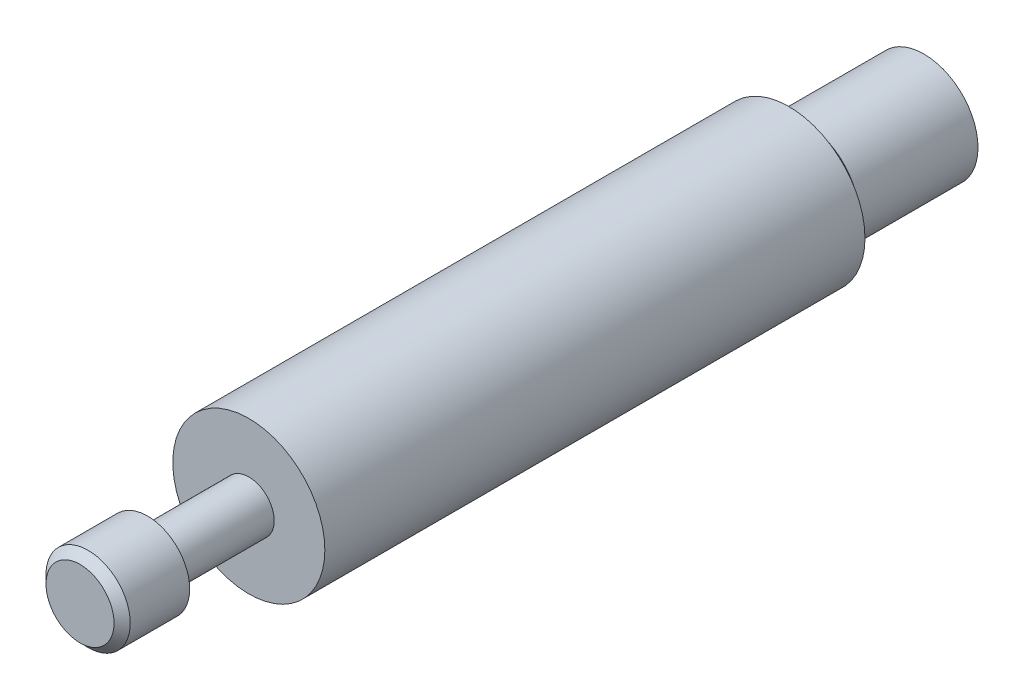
from build123d import *

# Parameters (mm, degrees)
SKETCH1_R      = 7.1501
EXTRUDE1_DEPTH = 25.4
SKETCH2_R      = 5.08
EXTRUDE2_DEPTH = 12.7
CHAMFER1_SIZE  = 1.524
SKETCH3_R      = 2.3876
EXTRUDE3_DEPTH = 9.525
SKETCH5_R      = 3.9624
EXTRUDE4_DEPTH = 6.35
CHAMFER2_SIZE  = 0.762


with BuildPart() as part:
    # Sketch1 → Extrude1 (new, symmetric)
    with BuildSketch(Plane.XY):
        Circle(SKETCH1_R)
    extrude(amount=EXTRUDE1_DEPTH, both=True)

    # Sketch2 → Extrude2 (add)
    with BuildSketch(Plane(origin=(0, 0, -25.4), x_dir=(-1, 0, 0), z_dir=(0, 0, -1))):
        with Locations(Location((0, 0, 0), (0, 0, 180))):
            Circle(SKETCH2_R)
    extrude(amount=EXTRUDE2_DEPTH)

    # Chamfer1
    chamfer1_edges = [part.edges().sort_by_distance(p)[0] for p in [
        (-5.08, 0, -25.4),
    ]]
    chamfer(chamfer1_edges, length=CHAMFER1_SIZE)

    # Sketch3 → Extrude3 (add)
    with BuildSketch(Plane.XY.offset(25.4)):
        with Locations(Location((0, 0, 0), (0, 0, 180))):
            Circle(SKETCH3_R)
    extrude(amount=EXTRUDE3_DEPTH)

    # Sketch5 → Extrude4 (add)
    with BuildSketch(Plane.XY.offset(34.925)):
        Circle(SKETCH5_R)
    extrude(amount=EXTRUDE4_DEPTH)

    # Chamfer2
    chamfer2_edges = [part.edges().sort_by_distance(p)[0] for p in [
        (-3.9624, 0, 41.275),
    ]]
    chamfer(chamfer2_edges, length=CHAMFER2_SIZE)


solid = part.part
